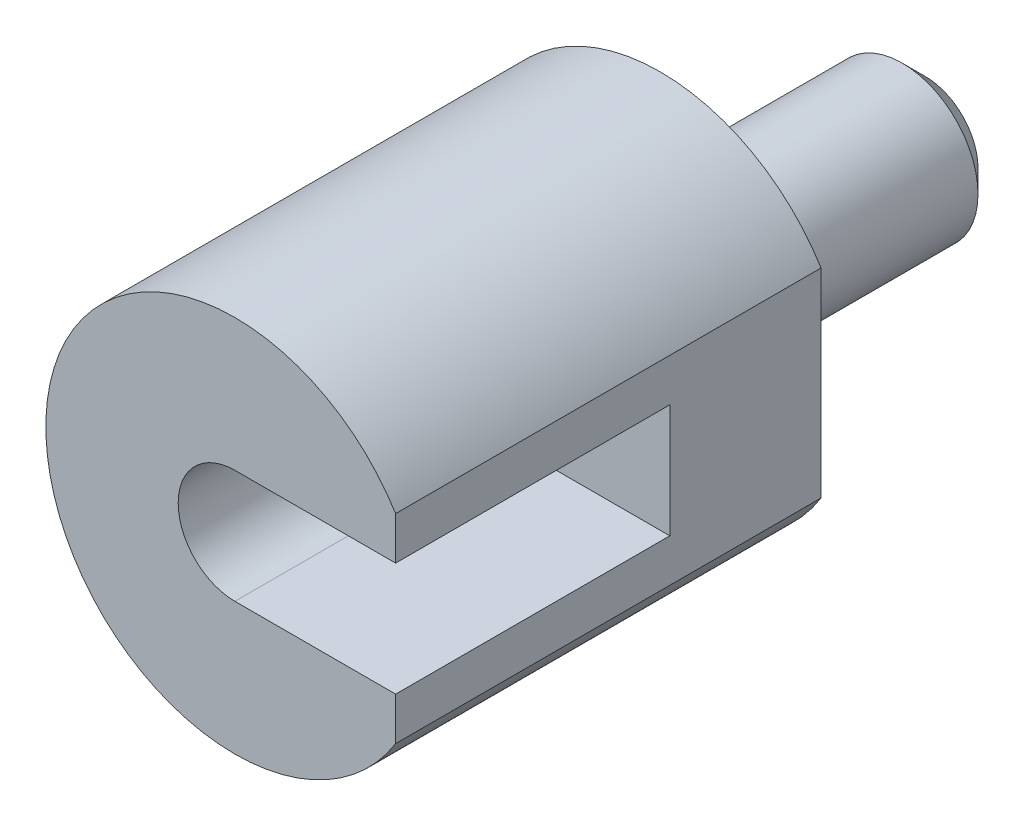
ISO-10303-21;
HEADER;
FILE_DESCRIPTION(('STEP AP214'),'2;1');
FILE_NAME('part.step','',(''),(''),'','','');
FILE_SCHEMA(('AUTOMOTIVE_DESIGN { 1 0 10303 214 1 1 1 1 }'));
ENDSEC;
DATA;
#1=APPLICATION_CONTEXT('core data for automotive mechanical design processes');
#2=APPLICATION_PROTOCOL_DEFINITION('international standard','automotive_design',2000,#1);
#3=PRODUCT_CONTEXT('',#1,'mechanical');
#4=PRODUCT('Part','Part','',(#3));
#5=PRODUCT_RELATED_PRODUCT_CATEGORY('part','',(#4));
#6=PRODUCT_DEFINITION_FORMATION('','',#4);
#7=PRODUCT_DEFINITION_CONTEXT('part definition',#1,'design');
#8=PRODUCT_DEFINITION('design','',#6,#7);
#9=PRODUCT_DEFINITION_SHAPE('','',#8);
#10=(LENGTH_UNIT() NAMED_UNIT(*) SI_UNIT(.MILLI.,.METRE.));
#11=(NAMED_UNIT(*) PLANE_ANGLE_UNIT() SI_UNIT($,.RADIAN.));
#12=(NAMED_UNIT(*) SI_UNIT($,.STERADIAN.) SOLID_ANGLE_UNIT());
#13=UNCERTAINTY_MEASURE_WITH_UNIT(LENGTH_MEASURE(1.E-05),#10,'distance_accuracy_value','');
#14=(GEOMETRIC_REPRESENTATION_CONTEXT(3) GLOBAL_UNCERTAINTY_ASSIGNED_CONTEXT((#13)) GLOBAL_UNIT_ASSIGNED_CONTEXT((#10,
#11,#12)) REPRESENTATION_CONTEXT('',''));
#15=CARTESIAN_POINT('',(0.,0.,0.));
#16=DIRECTION('',(0.,0.,1.));
#17=DIRECTION('',(1.,0.,0.));
#18=AXIS2_PLACEMENT_3D('',#15,#16,#17);
#19=CARTESIAN_POINT('',(0.,0.,0.));
#20=DIRECTION('',(0.,0.,1.));
#21=DIRECTION('',(1.,0.,0.));
#22=AXIS2_PLACEMENT_3D('',#19,#20,#21);
#23=CYLINDRICAL_SURFACE('',#22,3.);
#24=CARTESIAN_POINT('',(0.,0.,8.));
#25=DIRECTION('',(0.,0.,-1.));
#26=DIRECTION('',(-1.,0.,0.));
#27=AXIS2_PLACEMENT_3D('',#24,#25,#26);
#28=CIRCLE('',#27,3.);
#29=CARTESIAN_POINT('',(0.,3.,8.));
#30=VERTEX_POINT('',#29);
#31=CARTESIAN_POINT('',(0.,-3.,8.));
#32=VERTEX_POINT('',#31);
#33=EDGE_CURVE('E29',#30,#32,#28,.F.);
#34=ORIENTED_EDGE('',*,*,#33,.F.);
#35=DIRECTION('',(0.,0.,1.));
#36=VECTOR('',#35,1.);
#37=CARTESIAN_POINT('',(0.,3.,0.));
#38=LINE('',#37,#36);
#39=CARTESIAN_POINT('',(0.,3.,12.));
#40=VERTEX_POINT('',#39);
#41=EDGE_CURVE('E105',#30,#40,#38,.T.);
#42=ORIENTED_EDGE('',*,*,#41,.T.);
#43=CARTESIAN_POINT('',(0.,3.,15.));
#44=CARTESIAN_POINT('',(-0.0396077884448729,3.00000404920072,15.0000021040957));
#45=CARTESIAN_POINT('',(-0.0791945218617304,2.99921474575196,14.9984301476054));
#46=CARTESIAN_POINT('',(-0.158044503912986,2.99609322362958,14.9921747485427));
#47=CARTESIAN_POINT('',(-0.197307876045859,2.99376162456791,14.987492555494));
#48=CARTESIAN_POINT('',(-0.313819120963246,2.98455123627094,14.9689006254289));
#49=CARTESIAN_POINT('',(-0.390220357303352,2.97545587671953,14.9504446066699));
#50=CARTESIAN_POINT('',(-0.538376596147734,2.95225090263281,14.9022221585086));
#51=CARTESIAN_POINT('',(-0.610136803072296,2.93814702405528,14.8724686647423));
#52=CARTESIAN_POINT('',(-0.747633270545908,2.90620584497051,14.80268748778));
#53=CARTESIAN_POINT('',(-0.813363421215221,2.88836481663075,14.762649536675));
#54=CARTESIAN_POINT('',(-0.941266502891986,2.84934285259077,14.6707216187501));
#55=CARTESIAN_POINT('',(-1.00298960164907,2.8280257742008,14.618264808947));
#56=CARTESIAN_POINT('',(-1.11717425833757,2.78489728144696,14.5042113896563));
#57=CARTESIAN_POINT('',(-1.16962972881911,2.7630855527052,14.4426088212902));
#58=CARTESIAN_POINT('',(-1.2678787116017,2.71948400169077,14.3062741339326));
#59=CARTESIAN_POINT('',(-1.31283910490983,2.69782728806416,14.2308940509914));
#60=CARTESIAN_POINT('',(-1.38925306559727,2.65928927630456,14.0724470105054));
#61=CARTESIAN_POINT('',(-1.42071660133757,2.64240445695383,13.989385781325));
#62=CARTESIAN_POINT('',(-1.46719841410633,2.6168681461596,13.8230032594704));
#63=CARTESIAN_POINT('',(-1.48308842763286,2.60778427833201,13.7399952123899));
#64=CARTESIAN_POINT('',(-1.50064044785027,2.5977283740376,13.5720336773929));
#65=CARTESIAN_POINT('',(-1.50231619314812,2.59674850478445,13.4870821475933));
#66=CARTESIAN_POINT('',(-1.4920308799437,2.60266398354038,13.3285701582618));
#67=CARTESIAN_POINT('',(-1.48167661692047,2.60863158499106,13.254862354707));
#68=CARTESIAN_POINT('',(-1.45040931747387,2.62614368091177,13.1104156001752));
#69=CARTESIAN_POINT('',(-1.42949314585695,2.63768983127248,13.0396775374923));
#70=CARTESIAN_POINT('',(-1.37731504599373,2.66531195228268,12.9011572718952));
#71=CARTESIAN_POINT('',(-1.34582351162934,2.68148715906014,12.833482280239));
#72=CARTESIAN_POINT('',(-1.27356361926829,2.71655054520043,12.7040502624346));
#73=CARTESIAN_POINT('',(-1.23279083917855,2.73544001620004,12.6422960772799));
#74=CARTESIAN_POINT('',(-1.13710080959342,2.77669668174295,12.5182201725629));
#75=CARTESIAN_POINT('',(-1.08104579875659,2.79920121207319,12.4568185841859));
#76=CARTESIAN_POINT('',(-0.959336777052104,2.84321307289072,12.3438999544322));
#77=CARTESIAN_POINT('',(-0.893677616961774,2.86471986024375,12.2923882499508));
#78=CARTESIAN_POINT('',(-0.750740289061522,2.90554017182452,12.1984475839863));
#79=CARTESIAN_POINT('',(-0.673061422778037,2.92470337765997,12.1565583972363));
#80=CARTESIAN_POINT('',(-0.51060308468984,2.95738285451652,12.0868243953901));
#81=CARTESIAN_POINT('',(-0.425836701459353,2.97090927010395,12.0589543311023));
#82=CARTESIAN_POINT('',(-0.283652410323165,2.98707948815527,12.02596893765));
#83=CARTESIAN_POINT('',(-0.227507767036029,2.99189227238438,12.0162637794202));
#84=CARTESIAN_POINT('',(-0.114258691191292,2.99836613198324,12.0032671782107));
#85=CARTESIAN_POINT('',(-0.0571535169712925,3.00002464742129,11.9999809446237));
#86=CARTESIAN_POINT('',(0.,3.,12.));
#87=B_SPLINE_CURVE_WITH_KNOTS('',3,(#43,#44,#45,#46,#47,#48,#49,#50,#51,#52,#53,#54,#55,#56,#57,
#58,#59,#60,#61,#62,#63,#64,#65,#66,#67,#68,#69,#70,#71,#72,#73,#74,#75,#76,#77,#78,#79,#80,#81,
#82,#83,#84,#85,#86),.UNSPECIFIED.,.F.,.F.,(4,2,2,2,2,2,2,2,2,2,2,2,2,2,2,2,2,2,2,2,2,4),(0.,
0.118743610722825,0.237439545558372,0.473552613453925,0.709396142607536,0.945476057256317,
1.19571603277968,1.44611977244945,1.71595952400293,1.98559963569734,2.23909772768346,
2.4923507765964,2.71531851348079,2.93835247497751,3.16658087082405,3.39491823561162,
3.65219661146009,3.90961343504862,4.1791121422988,4.44812371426,4.61923932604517,
4.79049375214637),.UNSPECIFIED.);
#88=CARTESIAN_POINT('',(0.,3.,15.));
#89=VERTEX_POINT('',#88);
#90=EDGE_CURVE('E99',#89,#40,#87,.T.);
#91=ORIENTED_EDGE('',*,*,#90,.F.);
#92=CARTESIAN_POINT('',(0.,3.,22.5));
#93=VERTEX_POINT('',#92);
#94=EDGE_CURVE('E103',#89,#93,#38,.T.);
#95=ORIENTED_EDGE('',*,*,#94,.T.);
#96=CARTESIAN_POINT('',(0.,0.,22.5));
#97=DIRECTION('',(0.,0.,1.));
#98=DIRECTION('',(1.,0.,0.));
#99=AXIS2_PLACEMENT_3D('',#96,#97,#98);
#100=CIRCLE('',#99,3.);
#101=CARTESIAN_POINT('',(0.,-3.,22.5));
#102=VERTEX_POINT('',#101);
#103=EDGE_CURVE('E106',#93,#102,#100,.T.);
#104=ORIENTED_EDGE('',*,*,#103,.T.);
#105=DIRECTION('',(0.,0.,1.));
#106=VECTOR('',#105,1.);
#107=CARTESIAN_POINT('',(0.,-3.,0.));
#108=LINE('',#107,#106);
#109=CARTESIAN_POINT('',(0.,-3.,15.));
#110=VERTEX_POINT('',#109);
#111=EDGE_CURVE('E81',#110,#102,#108,.T.);
#112=ORIENTED_EDGE('',*,*,#111,.F.);
#113=CARTESIAN_POINT('',(0.,-3.,12.));
#114=CARTESIAN_POINT('',(-0.0396077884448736,-3.00000404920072,11.9999978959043));
#115=CARTESIAN_POINT('',(-0.0791945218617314,-2.99921474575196,12.0015698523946));
#116=CARTESIAN_POINT('',(-0.158044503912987,-2.99609322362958,12.0078252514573));
#117=CARTESIAN_POINT('',(-0.19730787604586,-2.99376162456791,12.012507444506));
#118=CARTESIAN_POINT('',(-0.313819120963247,-2.98455123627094,12.0310993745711));
#119=CARTESIAN_POINT('',(-0.390220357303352,-2.97545587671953,12.0495553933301));
#120=CARTESIAN_POINT('',(-0.538376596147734,-2.95225090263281,12.0977778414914));
#121=CARTESIAN_POINT('',(-0.610136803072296,-2.93814702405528,12.1275313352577));
#122=CARTESIAN_POINT('',(-0.747633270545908,-2.90620584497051,12.19731251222));
#123=CARTESIAN_POINT('',(-0.813363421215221,-2.88836481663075,12.237350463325));
#124=CARTESIAN_POINT('',(-0.941266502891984,-2.84934285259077,12.3292783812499));
#125=CARTESIAN_POINT('',(-1.00298960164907,-2.8280257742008,12.381735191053));
#126=CARTESIAN_POINT('',(-1.11717425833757,-2.78489728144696,12.4957886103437));
#127=CARTESIAN_POINT('',(-1.16962972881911,-2.7630855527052,12.5573911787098));
#128=CARTESIAN_POINT('',(-1.2678787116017,-2.71948400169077,12.6937258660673));
#129=CARTESIAN_POINT('',(-1.31283910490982,-2.69782728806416,12.7691059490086));
#130=CARTESIAN_POINT('',(-1.38925306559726,-2.65928927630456,12.9275529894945));
#131=CARTESIAN_POINT('',(-1.42071660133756,-2.64240445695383,13.010614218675));
#132=CARTESIAN_POINT('',(-1.46719841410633,-2.6168681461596,13.1769967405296));
#133=CARTESIAN_POINT('',(-1.48308842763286,-2.60778427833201,13.2600047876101));
#134=CARTESIAN_POINT('',(-1.50064044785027,-2.5977283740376,13.4279663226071));
#135=CARTESIAN_POINT('',(-1.50231619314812,-2.59674850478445,13.5129178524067));
#136=CARTESIAN_POINT('',(-1.49203087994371,-2.60266398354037,13.6714298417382));
#137=CARTESIAN_POINT('',(-1.48167661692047,-2.60863158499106,13.745137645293));
#138=CARTESIAN_POINT('',(-1.45040931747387,-2.62614368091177,13.8895843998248));
#139=CARTESIAN_POINT('',(-1.42949314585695,-2.63768983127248,13.9603224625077));
#140=CARTESIAN_POINT('',(-1.37731504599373,-2.66531195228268,14.0988427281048));
#141=CARTESIAN_POINT('',(-1.34582351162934,-2.68148715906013,14.166517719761));
#142=CARTESIAN_POINT('',(-1.27356361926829,-2.71655054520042,14.2959497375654));
#143=CARTESIAN_POINT('',(-1.23279083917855,-2.73544001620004,14.3577039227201));
#144=CARTESIAN_POINT('',(-1.13710080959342,-2.77669668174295,14.4817798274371));
#145=CARTESIAN_POINT('',(-1.08104579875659,-2.79920121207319,14.5431814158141));
#146=CARTESIAN_POINT('',(-0.959336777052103,-2.84321307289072,14.6561000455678));
#147=CARTESIAN_POINT('',(-0.893677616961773,-2.86471986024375,14.7076117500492));
#148=CARTESIAN_POINT('',(-0.750740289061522,-2.90554017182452,14.8015524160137));
#149=CARTESIAN_POINT('',(-0.673061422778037,-2.92470337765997,14.8434416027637));
#150=CARTESIAN_POINT('',(-0.510603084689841,-2.95738285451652,14.9131756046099));
#151=CARTESIAN_POINT('',(-0.425836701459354,-2.97090927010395,14.9410456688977));
#152=CARTESIAN_POINT('',(-0.283652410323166,-2.98707948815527,14.97403106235));
#153=CARTESIAN_POINT('',(-0.227507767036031,-2.99189227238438,14.9837362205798));
#154=CARTESIAN_POINT('',(-0.114258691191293,-2.99836613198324,14.9967328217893));
#155=CARTESIAN_POINT('',(-0.0571535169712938,-3.00002464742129,15.0000190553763));
#156=CARTESIAN_POINT('',(0.,-3.,15.));
#157=B_SPLINE_CURVE_WITH_KNOTS('',3,(#113,#114,#115,#116,#117,#118,#119,#120,#121,#122,#123,
#124,#125,#126,#127,#128,#129,#130,#131,#132,#133,#134,#135,#136,#137,#138,#139,#140,#141,#142,
#143,#144,#145,#146,#147,#148,#149,#150,#151,#152,#153,#154,#155,#156),.UNSPECIFIED.,.F.,.F.,(4,
2,2,2,2,2,2,2,2,2,2,2,2,2,2,2,2,2,2,2,2,4),(0.,0.118743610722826,0.237439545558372,
0.473552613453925,0.709396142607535,0.945476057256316,1.19571603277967,1.44611977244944,
1.71595952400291,1.98559963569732,2.23909772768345,2.4923507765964,2.71531851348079,
2.93835247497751,3.16658087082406,3.39491823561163,3.6521966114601,3.90961343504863,
4.17911214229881,4.44812371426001,4.61923932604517,4.79049375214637),.UNSPECIFIED.);
#158=CARTESIAN_POINT('',(0.,-3.,12.));
#159=VERTEX_POINT('',#158);
#160=EDGE_CURVE('E84',#159,#110,#157,.T.);
#161=ORIENTED_EDGE('',*,*,#160,.F.);
#162=EDGE_CURVE('E76',#32,#159,#108,.T.);
#163=ORIENTED_EDGE('',*,*,#162,.F.);
#164=EDGE_LOOP('',(#34,#42,#91,#95,#104,#112,#161,#163));
#165=FACE_BOUND('',#164,.T.);
#166=ADVANCED_FACE('F14',(#165),#23,.F.);
#167=CARTESIAN_POINT('',(0.,3.,0.));
#168=DIRECTION('',(0.,-1.,0.));
#169=DIRECTION('',(1.,0.,0.));
#170=AXIS2_PLACEMENT_3D('',#167,#168,#169);
#171=PLANE('',#170);
#172=ORIENTED_EDGE('',*,*,#41,.F.);
#173=DIRECTION('',(1.,0.,0.));
#174=VECTOR('',#173,1.);
#175=CARTESIAN_POINT('',(0.,3.,8.));
#176=LINE('',#175,#174);
#177=CARTESIAN_POINT('',(8.5,3.,8.));
#178=VERTEX_POINT('',#177);
#179=EDGE_CURVE('E88',#30,#178,#176,.T.);
#180=ORIENTED_EDGE('',*,*,#179,.T.);
#181=DIRECTION('',(0.,0.,1.));
#182=VECTOR('',#181,1.);
#183=CARTESIAN_POINT('',(8.5,3.,0.));
#184=LINE('',#183,#182);
#185=CARTESIAN_POINT('',(8.5,3.,22.5));
#186=VERTEX_POINT('',#185);
#187=EDGE_CURVE('E112',#178,#186,#184,.T.);
#188=ORIENTED_EDGE('',*,*,#187,.T.);
#189=DIRECTION('',(1.,0.,0.));
#190=VECTOR('',#189,1.);
#191=CARTESIAN_POINT('',(0.,3.,22.5));
#192=LINE('',#191,#190);
#193=EDGE_CURVE('E110',#93,#186,#192,.T.);
#194=ORIENTED_EDGE('',*,*,#193,.F.);
#195=ORIENTED_EDGE('',*,*,#94,.F.);
#196=CARTESIAN_POINT('',(0.,3.,13.5));
#197=DIRECTION('',(0.,-1.,0.));
#198=DIRECTION('',(1.,0.,0.));
#199=AXIS2_PLACEMENT_3D('',#196,#197,#198);
#200=CIRCLE('',#199,1.5);
#201=EDGE_CURVE('E87',#89,#40,#200,.F.);
#202=ORIENTED_EDGE('',*,*,#201,.T.);
#203=EDGE_LOOP('',(#172,#180,#188,#194,#195,#202));
#204=FACE_BOUND('',#203,.T.);
#205=ADVANCED_FACE('F108',(#204),#171,.T.);
#206=CARTESIAN_POINT('',(0.,-3.,0.));
#207=DIRECTION('',(0.,-1.,0.));
#208=DIRECTION('',(1.,0.,0.));
#209=AXIS2_PLACEMENT_3D('',#206,#207,#208);
#210=PLANE('',#209);
#211=DIRECTION('',(1.,0.,0.));
#212=VECTOR('',#211,1.);
#213=CARTESIAN_POINT('',(0.,-3.,8.));
#214=LINE('',#213,#212);
#215=CARTESIAN_POINT('',(8.5,-3.,8.));
#216=VERTEX_POINT('',#215);
#217=EDGE_CURVE('E37',#32,#216,#214,.T.);
#218=ORIENTED_EDGE('',*,*,#217,.F.);
#219=ORIENTED_EDGE('',*,*,#162,.T.);
#220=CARTESIAN_POINT('',(0.,-3.,13.5));
#221=DIRECTION('',(0.,-1.,0.));
#222=DIRECTION('',(1.,0.,0.));
#223=AXIS2_PLACEMENT_3D('',#220,#221,#222);
#224=CIRCLE('',#223,1.5);
#225=EDGE_CURVE('E9',#110,#159,#224,.F.);
#226=ORIENTED_EDGE('',*,*,#225,.F.);
#227=ORIENTED_EDGE('',*,*,#111,.T.);
#228=DIRECTION('',(1.,0.,0.));
#229=VECTOR('',#228,1.);
#230=CARTESIAN_POINT('',(0.,-3.,22.5));
#231=LINE('',#230,#229);
#232=CARTESIAN_POINT('',(8.5,-3.,22.5));
#233=VERTEX_POINT('',#232);
#234=EDGE_CURVE('E149',#102,#233,#231,.T.);
#235=ORIENTED_EDGE('',*,*,#234,.T.);
#236=DIRECTION('',(0.,0.,1.));
#237=VECTOR('',#236,1.);
#238=CARTESIAN_POINT('',(8.5,-3.,0.));
#239=LINE('',#238,#237);
#240=EDGE_CURVE('E80',#216,#233,#239,.T.);
#241=ORIENTED_EDGE('',*,*,#240,.F.);
#242=EDGE_LOOP('',(#218,#219,#226,#227,#235,#241));
#243=FACE_BOUND('',#242,.T.);
#244=ADVANCED_FACE('F78',(#243),#210,.F.);
#245=CARTESIAN_POINT('',(0.,0.,22.5));
#246=DIRECTION('',(0.,0.,1.));
#247=DIRECTION('',(1.,0.,0.));
#248=AXIS2_PLACEMENT_3D('',#245,#246,#247);
#249=PLANE('',#248);
#250=ORIENTED_EDGE('',*,*,#193,.T.);
#251=DIRECTION('',(0.,1.,0.));
#252=VECTOR('',#251,1.);
#253=CARTESIAN_POINT('',(8.5,3.,22.5));
#254=LINE('',#253,#252);
#255=CARTESIAN_POINT('',(8.5,5.26782687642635,22.5));
#256=VERTEX_POINT('',#255);
#257=EDGE_CURVE('E138',#186,#256,#254,.T.);
#258=ORIENTED_EDGE('',*,*,#257,.T.);
#259=CARTESIAN_POINT('',(0.,0.,22.5));
#260=DIRECTION('',(0.,0.,1.));
#261=DIRECTION('',(1.,0.,0.));
#262=AXIS2_PLACEMENT_3D('',#259,#260,#261);
#263=CIRCLE('',#262,10.);
#264=CARTESIAN_POINT('',(8.5,-5.26782687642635,22.5));
#265=VERTEX_POINT('',#264);
#266=EDGE_CURVE('E22',#256,#265,#263,.T.);
#267=ORIENTED_EDGE('',*,*,#266,.T.);
#268=DIRECTION('',(0.,1.,0.));
#269=VECTOR('',#268,1.);
#270=CARTESIAN_POINT('',(8.5,-5.26782687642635,22.5));
#271=LINE('',#270,#269);
#272=EDGE_CURVE('E136',#265,#233,#271,.T.);
#273=ORIENTED_EDGE('',*,*,#272,.T.);
#274=ORIENTED_EDGE('',*,*,#234,.F.);
#275=ORIENTED_EDGE('',*,*,#103,.F.);
#276=EDGE_LOOP('',(#250,#258,#267,#273,#274,#275));
#277=FACE_BOUND('',#276,.T.);
#278=ADVANCED_FACE('F16',(#277),#249,.T.);
#279=CARTESIAN_POINT('',(0.,0.,22.5));
#280=DIRECTION('',(0.,0.,1.));
#281=DIRECTION('',(1.,0.,0.));
#282=AXIS2_PLACEMENT_3D('',#279,#280,#281);
#283=CYLINDRICAL_SURFACE('',#282,10.);
#284=DIRECTION('',(0.,0.,1.));
#285=VECTOR('',#284,1.);
#286=CARTESIAN_POINT('',(8.5,-5.26782687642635,0.));
#287=LINE('',#286,#285);
#288=CARTESIAN_POINT('',(8.5,-5.26782687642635,0.));
#289=VERTEX_POINT('',#288);
#290=EDGE_CURVE('E144',#289,#265,#287,.T.);
#291=ORIENTED_EDGE('',*,*,#290,.T.);
#292=ORIENTED_EDGE('',*,*,#266,.F.);
#293=DIRECTION('',(0.,0.,1.));
#294=VECTOR('',#293,1.);
#295=CARTESIAN_POINT('',(8.5,5.26782687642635,0.));
#296=LINE('',#295,#294);
#297=CARTESIAN_POINT('',(8.5,5.26782687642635,0.));
#298=VERTEX_POINT('',#297);
#299=EDGE_CURVE('E115',#298,#256,#296,.T.);
#300=ORIENTED_EDGE('',*,*,#299,.F.);
#301=CARTESIAN_POINT('',(0.,0.,0.));
#302=DIRECTION('',(0.,0.,1.));
#303=DIRECTION('',(1.,0.,0.));
#304=AXIS2_PLACEMENT_3D('',#301,#302,#303);
#305=CIRCLE('',#304,10.);
#306=EDGE_CURVE('E127',#298,#289,#305,.T.);
#307=ORIENTED_EDGE('',*,*,#306,.T.);
#308=EDGE_LOOP('',(#291,#292,#300,#307));
#309=FACE_BOUND('',#308,.T.);
#310=ADVANCED_FACE('F141',(#309),#283,.T.);
#311=CARTESIAN_POINT('',(0.,-4.00000000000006,0.));
#312=DIRECTION('',(0.,0.,1.));
#313=DIRECTION('',(1.,0.,0.));
#314=AXIS2_PLACEMENT_3D('',#311,#312,#313);
#315=PLANE('',#314);
#316=DIRECTION('',(0.,1.,0.));
#317=VECTOR('',#316,1.);
#318=CARTESIAN_POINT('',(8.5,3.,0.));
#319=LINE('',#318,#317);
#320=EDGE_CURVE('E156',#289,#298,#319,.T.);
#321=ORIENTED_EDGE('',*,*,#320,.F.);
#322=ORIENTED_EDGE('',*,*,#306,.F.);
#323=EDGE_LOOP('',(#321,#322));
#324=FACE_BOUND('',#323,.T.);
#325=CARTESIAN_POINT('',(0.,0.,0.));
#326=DIRECTION('',(0.,0.,1.));
#327=DIRECTION('',(1.,0.,0.));
#328=AXIS2_PLACEMENT_3D('',#325,#326,#327);
#329=CIRCLE('',#328,4.00000000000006);
#330=CARTESIAN_POINT('',(4.00000000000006,0.,0.));
#331=VERTEX_POINT('',#330);
#332=EDGE_CURVE('E124',#331,#331,#329,.T.);
#333=ORIENTED_EDGE('',*,*,#332,.T.);
#334=EDGE_LOOP('',(#333));
#335=FACE_BOUND('',#334,.T.);
#336=ADVANCED_FACE('F160',(#324,#335),#315,.F.);
#337=CARTESIAN_POINT('',(0.,0.,22.5));
#338=DIRECTION('',(0.,0.,1.));
#339=DIRECTION('',(1.,0.,0.));
#340=AXIS2_PLACEMENT_3D('',#337,#338,#339);
#341=CYLINDRICAL_SURFACE('',#340,4.00000000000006);
#342=ORIENTED_EDGE('',*,*,#332,.F.);
#343=EDGE_LOOP('',(#342));
#344=FACE_BOUND('',#343,.T.);
#345=CARTESIAN_POINT('',(0.,0.,-12.8));
#346=DIRECTION('',(0.,0.,1.));
#347=DIRECTION('',(1.,0.,0.));
#348=AXIS2_PLACEMENT_3D('',#345,#346,#347);
#349=CIRCLE('',#348,4.00000000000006);
#350=CARTESIAN_POINT('',(4.00000000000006,0.,-12.8));
#351=VERTEX_POINT('',#350);
#352=EDGE_CURVE('E121',#351,#351,#349,.T.);
#353=ORIENTED_EDGE('',*,*,#352,.T.);
#354=EDGE_LOOP('',(#353));
#355=FACE_BOUND('',#354,.T.);
#356=ADVANCED_FACE('F163',(#344,#355),#341,.T.);
#357=CARTESIAN_POINT('',(0.,0.,-14.));
#358=DIRECTION('',(0.,0.,1.));
#359=DIRECTION('',(1.,0.,0.));
#360=AXIS2_PLACEMENT_3D('',#357,#358,#359);
#361=CONICAL_SURFACE('',#360,2.8,0.78539816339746);
#362=ORIENTED_EDGE('',*,*,#352,.F.);
#363=EDGE_LOOP('',(#362));
#364=FACE_BOUND('',#363,.T.);
#365=CARTESIAN_POINT('',(0.,0.,-14.));
#366=DIRECTION('',(0.,0.,1.));
#367=DIRECTION('',(1.,0.,0.));
#368=AXIS2_PLACEMENT_3D('',#365,#366,#367);
#369=CIRCLE('',#368,2.8);
#370=CARTESIAN_POINT('',(2.8,0.,-14.));
#371=VERTEX_POINT('',#370);
#372=EDGE_CURVE('E114',#371,#371,#369,.T.);
#373=ORIENTED_EDGE('',*,*,#372,.T.);
#374=EDGE_LOOP('',(#373));
#375=FACE_BOUND('',#374,.T.);
#376=ADVANCED_FACE('F169',(#364,#375),#361,.T.);
#377=CARTESIAN_POINT('',(0.,-2.8,-14.));
#378=DIRECTION('',(0.,0.,-1.));
#379=DIRECTION('',(-1.,0.,0.));
#380=AXIS2_PLACEMENT_3D('',#377,#378,#379);
#381=PLANE('',#380);
#382=ORIENTED_EDGE('',*,*,#372,.F.);
#383=EDGE_LOOP('',(#382));
#384=FACE_BOUND('',#383,.T.);
#385=ADVANCED_FACE('F175',(#384),#381,.T.);
#386=CARTESIAN_POINT('',(8.5,3.,0.));
#387=DIRECTION('',(1.,0.,0.));
#388=DIRECTION('',(0.,1.,0.));
#389=AXIS2_PLACEMENT_3D('',#386,#387,#388);
#390=PLANE('',#389);
#391=ORIENTED_EDGE('',*,*,#299,.T.);
#392=ORIENTED_EDGE('',*,*,#257,.F.);
#393=ORIENTED_EDGE('',*,*,#187,.F.);
#394=DIRECTION('',(0.,-1.,0.));
#395=VECTOR('',#394,1.);
#396=CARTESIAN_POINT('',(8.5,5.26782687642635,8.));
#397=LINE('',#396,#395);
#398=EDGE_CURVE('E211',#178,#216,#397,.T.);
#399=ORIENTED_EDGE('',*,*,#398,.T.);
#400=ORIENTED_EDGE('',*,*,#240,.T.);
#401=ORIENTED_EDGE('',*,*,#272,.F.);
#402=ORIENTED_EDGE('',*,*,#290,.F.);
#403=ORIENTED_EDGE('',*,*,#320,.T.);
#404=EDGE_LOOP('',(#391,#392,#393,#399,#400,#401,#402,#403));
#405=FACE_BOUND('',#404,.T.);
#406=ADVANCED_FACE('F94',(#405),#390,.T.);
#407=CARTESIAN_POINT('',(0.,-10.,13.5));
#408=DIRECTION('',(0.,-1.,0.));
#409=DIRECTION('',(1.,0.,0.));
#410=AXIS2_PLACEMENT_3D('',#407,#408,#409);
#411=CYLINDRICAL_SURFACE('',#410,1.5);
#412=ORIENTED_EDGE('',*,*,#225,.T.);
#413=ORIENTED_EDGE('',*,*,#160,.T.);
#414=EDGE_LOOP('',(#412,#413));
#415=FACE_BOUND('',#414,.T.);
#416=ORIENTED_EDGE('',*,*,#201,.F.);
#417=ORIENTED_EDGE('',*,*,#90,.T.);
#418=EDGE_LOOP('',(#416,#417));
#419=FACE_BOUND('',#418,.T.);
#420=ADVANCED_FACE('F90',(#415,#419),#411,.T.);
#421=CARTESIAN_POINT('',(0.,0.,8.));
#422=DIRECTION('',(0.,0.,-1.));
#423=DIRECTION('',(-1.,0.,0.));
#424=AXIS2_PLACEMENT_3D('',#421,#422,#423);
#425=PLANE('',#424);
#426=ORIENTED_EDGE('',*,*,#179,.F.);
#427=ORIENTED_EDGE('',*,*,#33,.T.);
#428=ORIENTED_EDGE('',*,*,#217,.T.);
#429=ORIENTED_EDGE('',*,*,#398,.F.);
#430=EDGE_LOOP('',(#426,#427,#428,#429));
#431=FACE_BOUND('',#430,.T.);
#432=ADVANCED_FACE('F93',(#431),#425,.F.);
#433=CLOSED_SHELL('',(#166,#205,#244,#278,#310,#336,#356,#376,#385,#406,#420,#432));
#434=MANIFOLD_SOLID_BREP('B1',#433);
#435=ADVANCED_BREP_SHAPE_REPRESENTATION('',(#18,#434),#14);
#436=SHAPE_DEFINITION_REPRESENTATION(#9,#435);
ENDSEC;
END-ISO-10303-21;
